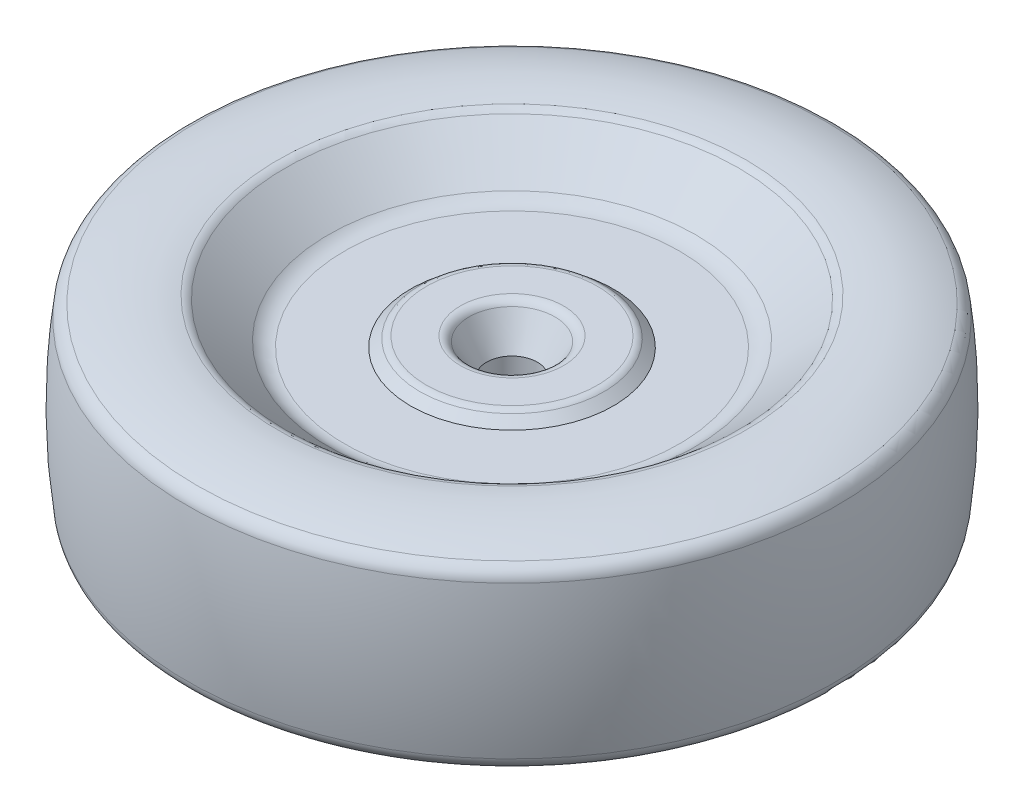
from build123d import *


with BuildPart() as part:
    # Sketch 1 → Revolve 1 (revolve)
    with BuildSketch(Plane.XY, mode=Mode.PRIVATE) as revolve_1_sk:
        with BuildLine():
            Line((10, -10), (10, 10))
            Line((10, 10), (33, 10))
            ThreePointArc((33, 10), (34.708721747, 10.301035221), (36.211689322, 11.167892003))
            Line((36.211689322, 11.167892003), (44.720666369, 18.299264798))
            ThreePointArc((44.720666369, 18.299264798), (45.403541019, 18.729856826), (46.176508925, 18.962768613))
            ThreePointArc((46.176508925, 18.962768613), (54.236816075, 19.215702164), (62.104408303, 17.445527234))
            ThreePointArc((62.104408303, 17.445527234), (63.425889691, 16.49790392), (64.058808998, 15))
            ThreePointArc((64.058808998, 15), (65, 0), (64.058808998, -15))
            ThreePointArc((64.058808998, -15), (63.425889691, -16.49790392), (62.104408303, -17.445527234))
            ThreePointArc((62.104408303, -17.445527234), (54.236816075, -19.215702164), (46.176508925, -18.962768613))
            ThreePointArc((46.176508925, -18.962768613), (45.403541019, -18.729856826), (44.720666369, -18.299264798))
            Line((44.720666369, -18.299264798), (36.211689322, -11.167892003))
            ThreePointArc((36.211689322, -11.167892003), (34.708721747, -10.301035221), (33, -10))
            Line((33, -10), (10, -10))
        make_face()
    revolve(revolve_1_sk.sketch.rotate(Axis((0, 0, 0), (0, 1, 0)), 90), axis=Axis((0, 0, 0), (0, 1, 0)))

    # Sketch 4 → Revolve 2 (revolve)
    with BuildSketch(Plane(origin=(0, 0, 0), x_dir=(0, 0, -1), z_dir=(1, 0, 0))):
        with BuildLine():
            Line((-20, 10), (-18.174127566, 11.532088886))
            ThreePointArc((-18.174127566, 11.532088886), (-17.572592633, 11.879385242), (-16.888552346, 12))
            Line((-16.888552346, 12), (-10.196152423, 12))
            ThreePointArc((-10.196152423, 12), (-9.196152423, 11.732050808), (-8.464101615, 11))
            Line((-8.464101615, 11), (-5, 5))
            Line((-5, 5), (-5, -5))
            Line((-5, -5), (-8.464101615, -11))
            ThreePointArc((-8.464101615, -11), (-9.196152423, -11.732050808), (-10.196152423, -12))
            Line((-10.196152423, -12), (-16.888552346, -12))
            ThreePointArc((-16.888552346, -12), (-17.572592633, -11.879385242), (-18.174127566, -11.532088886))
            Line((-18.174127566, -11.532088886), (-20, -10))
            Line((-20, -10), (-10, -10))
            Line((-10, -10), (-10, 10))
            Line((-10, 10), (-20, 10))
        make_face()
    revolve(axis=Axis((0, 0, 0), (0, -1, 0)))


solid = part.part
